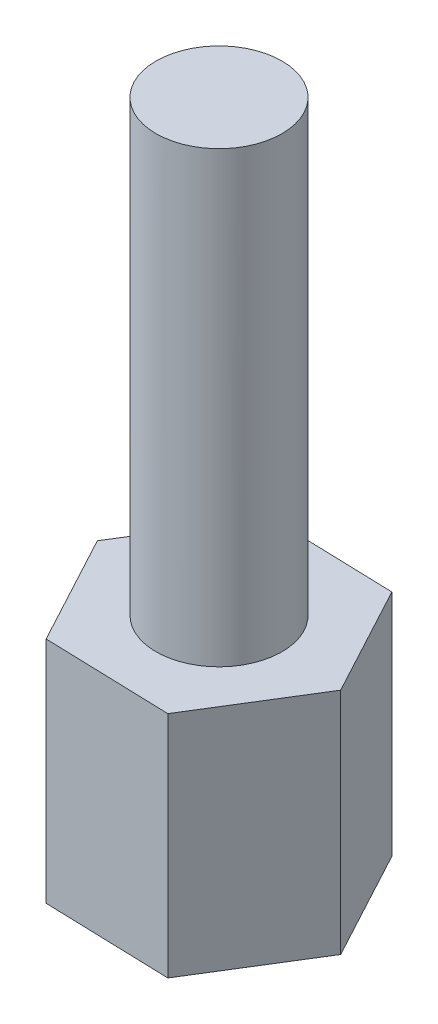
ISO-10303-21;
HEADER;
FILE_DESCRIPTION(('STEP AP214'),'2;1');
FILE_NAME('part.step','',(''),(''),'','','');
FILE_SCHEMA(('AUTOMOTIVE_DESIGN { 1 0 10303 214 1 1 1 1 }'));
ENDSEC;
DATA;
#1=APPLICATION_CONTEXT('core data for automotive mechanical design processes');
#2=APPLICATION_PROTOCOL_DEFINITION('international standard','automotive_design',2000,#1);
#3=PRODUCT_CONTEXT('',#1,'mechanical');
#4=PRODUCT('Part','Part','',(#3));
#5=PRODUCT_RELATED_PRODUCT_CATEGORY('part','',(#4));
#6=PRODUCT_DEFINITION_FORMATION('','',#4);
#7=PRODUCT_DEFINITION_CONTEXT('part definition',#1,'design');
#8=PRODUCT_DEFINITION('design','',#6,#7);
#9=PRODUCT_DEFINITION_SHAPE('','',#8);
#10=(LENGTH_UNIT() NAMED_UNIT(*) SI_UNIT(.MILLI.,.METRE.));
#11=(NAMED_UNIT(*) PLANE_ANGLE_UNIT() SI_UNIT($,.RADIAN.));
#12=(NAMED_UNIT(*) SI_UNIT($,.STERADIAN.) SOLID_ANGLE_UNIT());
#13=UNCERTAINTY_MEASURE_WITH_UNIT(LENGTH_MEASURE(1.E-05),#10,'distance_accuracy_value','');
#14=(GEOMETRIC_REPRESENTATION_CONTEXT(3) GLOBAL_UNCERTAINTY_ASSIGNED_CONTEXT((#13)) GLOBAL_UNIT_ASSIGNED_CONTEXT((#10,
#11,#12)) REPRESENTATION_CONTEXT('',''));
#15=CARTESIAN_POINT('',(0.,0.,0.));
#16=DIRECTION('',(0.,0.,1.));
#17=DIRECTION('',(1.,0.,0.));
#18=AXIS2_PLACEMENT_3D('',#15,#16,#17);
#19=CARTESIAN_POINT('',(-1.44310708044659,5.,2.33201099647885));
#20=DIRECTION('',(0.,-1.,0.));
#21=DIRECTION('',(0.,0.,-1.));
#22=AXIS2_PLACEMENT_3D('',#19,#20,#21);
#23=PLANE('',#22);
#24=DIRECTION('',(0.999533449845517,0.,0.0305431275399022));
#25=VECTOR('',#24,1.);
#26=CARTESIAN_POINT('',(-1.44310708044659,5.,2.33201099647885));
#27=LINE('',#26,#25);
#28=CARTESIAN_POINT('',(-1.44310708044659,5.,2.33201099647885));
#29=VERTEX_POINT('',#28);
#30=CARTESIAN_POINT('',(1.29802722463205,5.,2.41577289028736));
#31=VERTEX_POINT('',#30);
#32=EDGE_CURVE('E121',#29,#31,#27,.T.);
#33=ORIENTED_EDGE('',*,*,#32,.T.);
#34=DIRECTION('',(0.526217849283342,0.,-0.850349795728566));
#35=VECTOR('',#34,1.);
#36=CARTESIAN_POINT('',(1.29802722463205,5.,2.41577289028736));
#37=LINE('',#36,#35);
#38=CARTESIAN_POINT('',(2.74113430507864,5.,0.0837618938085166));
#39=VERTEX_POINT('',#38);
#40=EDGE_CURVE('E101',#31,#39,#37,.T.);
#41=ORIENTED_EDGE('',*,*,#40,.T.);
#42=DIRECTION('',(-0.473315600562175,0.,-0.880892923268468));
#43=VECTOR('',#42,1.);
#44=CARTESIAN_POINT('',(2.74113430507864,5.,0.0837618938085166));
#45=LINE('',#44,#43);
#46=CARTESIAN_POINT('',(1.44310708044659,5.,-2.33201099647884));
#47=VERTEX_POINT('',#46);
#48=EDGE_CURVE('E124',#39,#47,#45,.T.);
#49=ORIENTED_EDGE('',*,*,#48,.T.);
#50=DIRECTION('',(-0.999533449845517,0.,-0.0305431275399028));
#51=VECTOR('',#50,1.);
#52=CARTESIAN_POINT('',(1.44310708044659,5.,-2.33201099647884));
#53=LINE('',#52,#51);
#54=CARTESIAN_POINT('',(-1.29802722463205,5.,-2.41577289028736));
#55=VERTEX_POINT('',#54);
#56=EDGE_CURVE('E126',#47,#55,#53,.T.);
#57=ORIENTED_EDGE('',*,*,#56,.T.);
#58=DIRECTION('',(-0.526217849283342,0.,0.850349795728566));
#59=VECTOR('',#58,1.);
#60=CARTESIAN_POINT('',(-1.29802722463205,5.,-2.41577289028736));
#61=LINE('',#60,#59);
#62=CARTESIAN_POINT('',(-2.74113430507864,5.,-0.0837618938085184));
#63=VERTEX_POINT('',#62);
#64=EDGE_CURVE('E54',#55,#63,#61,.T.);
#65=ORIENTED_EDGE('',*,*,#64,.T.);
#66=DIRECTION('',(0.473315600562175,0.,0.880892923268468));
#67=VECTOR('',#66,1.);
#68=CARTESIAN_POINT('',(-2.74113430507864,5.,-0.0837618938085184));
#69=LINE('',#68,#67);
#70=EDGE_CURVE('E49',#63,#29,#69,.T.);
#71=ORIENTED_EDGE('',*,*,#70,.T.);
#72=EDGE_LOOP('',(#33,#41,#49,#57,#65,#71));
#73=FACE_BOUND('',#72,.T.);
#74=CARTESIAN_POINT('',(0.,5.,0.));
#75=DIRECTION('',(0.,-1.,0.));
#76=DIRECTION('',(0.,0.,-1.));
#77=AXIS2_PLACEMENT_3D('',#74,#75,#76);
#78=CIRCLE('',#77,1.375);
#79=CARTESIAN_POINT('',(0.,5.,-1.375));
#80=VERTEX_POINT('',#79);
#81=EDGE_CURVE('E11',#80,#80,#78,.F.);
#82=ORIENTED_EDGE('',*,*,#81,.F.);
#83=EDGE_LOOP('',(#82));
#84=FACE_BOUND('',#83,.T.);
#85=ADVANCED_FACE('F34',(#73,#84),#23,.F.);
#86=CARTESIAN_POINT('',(-1.44310708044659,5.,2.33201099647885));
#87=DIRECTION('',(0.0305431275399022,0.,-0.999533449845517));
#88=DIRECTION('',(-0.999533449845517,0.,-0.0305431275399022));
#89=AXIS2_PLACEMENT_3D('',#86,#87,#88);
#90=PLANE('',#89);
#91=DIRECTION('',(0.999533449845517,0.,0.0305431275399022));
#92=VECTOR('',#91,1.);
#93=CARTESIAN_POINT('',(-1.44310708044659,0.,2.33201099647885));
#94=LINE('',#93,#92);
#95=CARTESIAN_POINT('',(-1.44310708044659,0.,2.33201099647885));
#96=VERTEX_POINT('',#95);
#97=CARTESIAN_POINT('',(1.29802722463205,0.,2.41577289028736));
#98=VERTEX_POINT('',#97);
#99=EDGE_CURVE('E92',#96,#98,#94,.T.);
#100=ORIENTED_EDGE('',*,*,#99,.T.);
#101=DIRECTION('',(0.,-1.,0.));
#102=VECTOR('',#101,1.);
#103=CARTESIAN_POINT('',(1.29802722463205,5.,2.41577289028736));
#104=LINE('',#103,#102);
#105=EDGE_CURVE('E42',#31,#98,#104,.T.);
#106=ORIENTED_EDGE('',*,*,#105,.F.);
#107=ORIENTED_EDGE('',*,*,#32,.F.);
#108=DIRECTION('',(0.,-1.,0.));
#109=VECTOR('',#108,1.);
#110=CARTESIAN_POINT('',(-1.44310708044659,5.,2.33201099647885));
#111=LINE('',#110,#109);
#112=EDGE_CURVE('E106',#29,#96,#111,.T.);
#113=ORIENTED_EDGE('',*,*,#112,.T.);
#114=EDGE_LOOP('',(#100,#106,#107,#113));
#115=FACE_BOUND('',#114,.T.);
#116=ADVANCED_FACE('F36',(#115),#90,.F.);
#117=CARTESIAN_POINT('',(1.29802722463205,5.,2.41577289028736));
#118=DIRECTION('',(-0.850349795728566,0.,-0.526217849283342));
#119=DIRECTION('',(-0.526217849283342,0.,0.850349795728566));
#120=AXIS2_PLACEMENT_3D('',#117,#118,#119);
#121=PLANE('',#120);
#122=DIRECTION('',(0.526217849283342,0.,-0.850349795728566));
#123=VECTOR('',#122,1.);
#124=CARTESIAN_POINT('',(1.29802722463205,0.,2.41577289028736));
#125=LINE('',#124,#123);
#126=CARTESIAN_POINT('',(2.74113430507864,0.,0.0837618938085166));
#127=VERTEX_POINT('',#126);
#128=EDGE_CURVE('E87',#98,#127,#125,.T.);
#129=ORIENTED_EDGE('',*,*,#128,.T.);
#130=DIRECTION('',(0.,-1.,0.));
#131=VECTOR('',#130,1.);
#132=CARTESIAN_POINT('',(2.74113430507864,5.,0.0837618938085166));
#133=LINE('',#132,#131);
#134=EDGE_CURVE('E104',#39,#127,#133,.T.);
#135=ORIENTED_EDGE('',*,*,#134,.F.);
#136=ORIENTED_EDGE('',*,*,#40,.F.);
#137=ORIENTED_EDGE('',*,*,#105,.T.);
#138=EDGE_LOOP('',(#129,#135,#136,#137));
#139=FACE_BOUND('',#138,.T.);
#140=ADVANCED_FACE('F100',(#139),#121,.F.);
#141=CARTESIAN_POINT('',(2.74113430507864,5.,0.0837618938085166));
#142=DIRECTION('',(-0.880892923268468,0.,0.473315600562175));
#143=DIRECTION('',(0.473315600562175,0.,0.880892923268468));
#144=AXIS2_PLACEMENT_3D('',#141,#142,#143);
#145=PLANE('',#144);
#146=DIRECTION('',(-0.473315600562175,0.,-0.880892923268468));
#147=VECTOR('',#146,1.);
#148=CARTESIAN_POINT('',(2.74113430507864,0.,0.0837618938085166));
#149=LINE('',#148,#147);
#150=CARTESIAN_POINT('',(1.44310708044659,0.,-2.33201099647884));
#151=VERTEX_POINT('',#150);
#152=EDGE_CURVE('E94',#127,#151,#149,.T.);
#153=ORIENTED_EDGE('',*,*,#152,.T.);
#154=DIRECTION('',(0.,-1.,0.));
#155=VECTOR('',#154,1.);
#156=CARTESIAN_POINT('',(1.44310708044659,5.,-2.33201099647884));
#157=LINE('',#156,#155);
#158=EDGE_CURVE('E137',#47,#151,#157,.T.);
#159=ORIENTED_EDGE('',*,*,#158,.F.);
#160=ORIENTED_EDGE('',*,*,#48,.F.);
#161=ORIENTED_EDGE('',*,*,#134,.T.);
#162=EDGE_LOOP('',(#153,#159,#160,#161));
#163=FACE_BOUND('',#162,.T.);
#164=ADVANCED_FACE('F142',(#163),#145,.F.);
#165=CARTESIAN_POINT('',(1.44310708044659,5.,-2.33201099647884));
#166=DIRECTION('',(-0.0305431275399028,0.,0.999533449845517));
#167=DIRECTION('',(0.999533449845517,0.,0.0305431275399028));
#168=AXIS2_PLACEMENT_3D('',#165,#166,#167);
#169=PLANE('',#168);
#170=DIRECTION('',(-0.999533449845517,0.,-0.0305431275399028));
#171=VECTOR('',#170,1.);
#172=CARTESIAN_POINT('',(1.44310708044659,0.,-2.33201099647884));
#173=LINE('',#172,#171);
#174=CARTESIAN_POINT('',(-1.29802722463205,0.,-2.41577289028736));
#175=VERTEX_POINT('',#174);
#176=EDGE_CURVE('E115',#151,#175,#173,.T.);
#177=ORIENTED_EDGE('',*,*,#176,.T.);
#178=DIRECTION('',(0.,-1.,0.));
#179=VECTOR('',#178,1.);
#180=CARTESIAN_POINT('',(-1.29802722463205,5.,-2.41577289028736));
#181=LINE('',#180,#179);
#182=EDGE_CURVE('E134',#55,#175,#181,.T.);
#183=ORIENTED_EDGE('',*,*,#182,.F.);
#184=ORIENTED_EDGE('',*,*,#56,.F.);
#185=ORIENTED_EDGE('',*,*,#158,.T.);
#186=EDGE_LOOP('',(#177,#183,#184,#185));
#187=FACE_BOUND('',#186,.T.);
#188=ADVANCED_FACE('F148',(#187),#169,.F.);
#189=CARTESIAN_POINT('',(-1.29802722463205,5.,-2.41577289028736));
#190=DIRECTION('',(0.850349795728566,0.,0.526217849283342));
#191=DIRECTION('',(0.526217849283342,0.,-0.850349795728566));
#192=AXIS2_PLACEMENT_3D('',#189,#190,#191);
#193=PLANE('',#192);
#194=DIRECTION('',(-0.526217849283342,0.,0.850349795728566));
#195=VECTOR('',#194,1.);
#196=CARTESIAN_POINT('',(-1.29802722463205,0.,-2.41577289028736));
#197=LINE('',#196,#195);
#198=CARTESIAN_POINT('',(-2.74113430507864,0.,-0.0837618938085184));
#199=VERTEX_POINT('',#198);
#200=EDGE_CURVE('E117',#175,#199,#197,.T.);
#201=ORIENTED_EDGE('',*,*,#200,.T.);
#202=DIRECTION('',(0.,-1.,0.));
#203=VECTOR('',#202,1.);
#204=CARTESIAN_POINT('',(-2.74113430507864,5.,-0.0837618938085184));
#205=LINE('',#204,#203);
#206=EDGE_CURVE('E131',#63,#199,#205,.T.);
#207=ORIENTED_EDGE('',*,*,#206,.F.);
#208=ORIENTED_EDGE('',*,*,#64,.F.);
#209=ORIENTED_EDGE('',*,*,#182,.T.);
#210=EDGE_LOOP('',(#201,#207,#208,#209));
#211=FACE_BOUND('',#210,.T.);
#212=ADVANCED_FACE('F151',(#211),#193,.F.);
#213=CARTESIAN_POINT('',(-2.74113430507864,5.,-0.0837618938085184));
#214=DIRECTION('',(0.880892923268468,0.,-0.473315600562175));
#215=DIRECTION('',(-0.473315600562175,0.,-0.880892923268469));
#216=AXIS2_PLACEMENT_3D('',#213,#214,#215);
#217=PLANE('',#216);
#218=DIRECTION('',(0.473315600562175,0.,0.880892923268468));
#219=VECTOR('',#218,1.);
#220=CARTESIAN_POINT('',(-2.74113430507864,0.,-0.0837618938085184));
#221=LINE('',#220,#219);
#222=EDGE_CURVE('E119',#199,#96,#221,.T.);
#223=ORIENTED_EDGE('',*,*,#222,.T.);
#224=ORIENTED_EDGE('',*,*,#112,.F.);
#225=ORIENTED_EDGE('',*,*,#70,.F.);
#226=ORIENTED_EDGE('',*,*,#206,.T.);
#227=EDGE_LOOP('',(#223,#224,#225,#226));
#228=FACE_BOUND('',#227,.T.);
#229=ADVANCED_FACE('F153',(#228),#217,.F.);
#230=CARTESIAN_POINT('',(-1.44310708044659,0.,2.33201099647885));
#231=DIRECTION('',(0.,-1.,0.));
#232=DIRECTION('',(0.,0.,-1.));
#233=AXIS2_PLACEMENT_3D('',#230,#231,#232);
#234=PLANE('',#233);
#235=CARTESIAN_POINT('',(0.,0.,0.));
#236=DIRECTION('',(0.,-1.,0.));
#237=DIRECTION('',(0.,0.,-1.));
#238=AXIS2_PLACEMENT_3D('',#235,#236,#237);
#239=CIRCLE('',#238,1.36);
#240=CARTESIAN_POINT('',(0.,0.,-1.36));
#241=VERTEX_POINT('',#240);
#242=EDGE_CURVE('E188',#241,#241,#239,.T.);
#243=ORIENTED_EDGE('',*,*,#242,.F.);
#244=EDGE_LOOP('',(#243));
#245=FACE_BOUND('',#244,.T.);
#246=ORIENTED_EDGE('',*,*,#99,.F.);
#247=ORIENTED_EDGE('',*,*,#222,.F.);
#248=ORIENTED_EDGE('',*,*,#200,.F.);
#249=ORIENTED_EDGE('',*,*,#176,.F.);
#250=ORIENTED_EDGE('',*,*,#152,.F.);
#251=ORIENTED_EDGE('',*,*,#128,.F.);
#252=EDGE_LOOP('',(#246,#247,#248,#249,#250,#251));
#253=FACE_BOUND('',#252,.T.);
#254=ADVANCED_FACE('F89',(#245,#253),#234,.T.);
#255=CARTESIAN_POINT('',(0.,14.8,0.));
#256=DIRECTION('',(0.,-1.,0.));
#257=DIRECTION('',(0.,0.,-1.));
#258=AXIS2_PLACEMENT_3D('',#255,#256,#257);
#259=CYLINDRICAL_SURFACE('',#258,1.375);
#260=CARTESIAN_POINT('',(0.,14.8,0.));
#261=DIRECTION('',(0.,1.,0.));
#262=DIRECTION('',(0.,0.,1.));
#263=AXIS2_PLACEMENT_3D('',#260,#261,#262);
#264=CIRCLE('',#263,1.375);
#265=CARTESIAN_POINT('',(0.,14.8,1.375));
#266=VERTEX_POINT('',#265);
#267=EDGE_CURVE('E107',#266,#266,#264,.T.);
#268=ORIENTED_EDGE('',*,*,#267,.F.);
#269=EDGE_LOOP('',(#268));
#270=FACE_BOUND('',#269,.T.);
#271=ORIENTED_EDGE('',*,*,#81,.T.);
#272=EDGE_LOOP('',(#271));
#273=FACE_BOUND('',#272,.T.);
#274=ADVANCED_FACE('F160',(#270,#273),#259,.T.);
#275=CARTESIAN_POINT('',(0.,14.8,0.));
#276=DIRECTION('',(0.,1.,0.));
#277=DIRECTION('',(0.,0.,1.));
#278=AXIS2_PLACEMENT_3D('',#275,#276,#277);
#279=PLANE('',#278);
#280=ORIENTED_EDGE('',*,*,#267,.T.);
#281=EDGE_LOOP('',(#280));
#282=FACE_BOUND('',#281,.T.);
#283=ADVANCED_FACE('F172',(#282),#279,.T.);
#284=CARTESIAN_POINT('',(0.,4.,0.));
#285=DIRECTION('',(0.,-1.,0.));
#286=DIRECTION('',(0.,0.,-1.));
#287=AXIS2_PLACEMENT_3D('',#284,#285,#286);
#288=CYLINDRICAL_SURFACE('',#287,1.36);
#289=CARTESIAN_POINT('',(0.,4.,0.));
#290=DIRECTION('',(0.,-1.,0.));
#291=DIRECTION('',(0.,0.,-1.));
#292=AXIS2_PLACEMENT_3D('',#289,#290,#291);
#293=CIRCLE('',#292,1.36);
#294=CARTESIAN_POINT('',(0.,4.,-1.36));
#295=VERTEX_POINT('',#294);
#296=EDGE_CURVE('E110',#295,#295,#293,.T.);
#297=ORIENTED_EDGE('',*,*,#296,.F.);
#298=EDGE_LOOP('',(#297));
#299=FACE_BOUND('',#298,.T.);
#300=ORIENTED_EDGE('',*,*,#242,.T.);
#301=EDGE_LOOP('',(#300));
#302=FACE_BOUND('',#301,.T.);
#303=ADVANCED_FACE('F176',(#299,#302),#288,.F.);
#304=CARTESIAN_POINT('',(0.,4.,0.));
#305=DIRECTION('',(0.,-1.,0.));
#306=DIRECTION('',(0.,0.,-1.));
#307=AXIS2_PLACEMENT_3D('',#304,#305,#306);
#308=PLANE('',#307);
#309=ORIENTED_EDGE('',*,*,#296,.T.);
#310=EDGE_LOOP('',(#309));
#311=FACE_BOUND('',#310,.T.);
#312=ADVANCED_FACE('F180',(#311),#308,.T.);
#313=CLOSED_SHELL('',(#85,#116,#140,#164,#188,#212,#229,#254,#274,#283,#303,#312));
#314=MANIFOLD_SOLID_BREP('B2',#313);
#315=ADVANCED_BREP_SHAPE_REPRESENTATION('',(#18,#314),#14);
#316=SHAPE_DEFINITION_REPRESENTATION(#9,#315);
ENDSEC;
END-ISO-10303-21;
